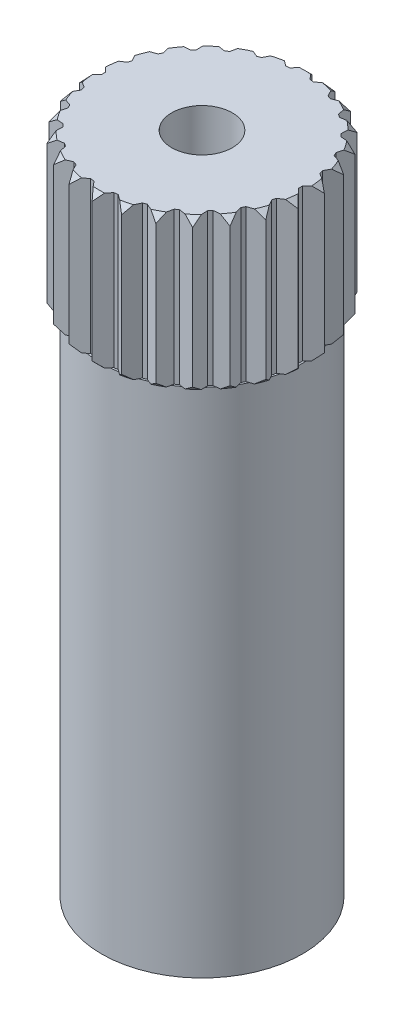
from build123d import *

# Parameters (mm, degrees)
SKETCH12_R          = 2.9
BOSS_EXTRUDE4_DEPTH = 13.5
SKETCH13_R          = 2.6
BOSS_EXTRUDE5_DEPTH = 4
BOSS_EXTRUDE6_REACH = 19.974
CIRPATTERN1_COUNT   = 26
SKETCH16_R          = 0.8
CUT_EXTRUDE1_DEPTH  = 4
SKETCH17_W          = 0.25
SKETCH17_H          = 13.5


with BuildPart() as part:
    # Sketch12 → Boss-Extrude4 (new body)
    with BuildSketch(Plane(origin=(0, 0, 0), x_dir=(1, 0, 0), z_dir=(0, 1, 0))):
        with Locations(Location((0, 0, 0), (0, 0, 270))):
            Circle(SKETCH12_R)
    extrude(amount=BOSS_EXTRUDE4_DEPTH)

    # Sketch13 → Boss-Extrude5 (add)
    with BuildSketch(Plane(origin=(0, 13.5, 0), x_dir=(1, 0, 0), z_dir=(0, 1, 0))):
        with Locations(Location((0, 0, 0), (0, 0, 270))):
            Circle(SKETCH13_R)
    extrude(amount=BOSS_EXTRUDE5_DEPTH)

    # Sketch14 → Boss-Extrude6 (add, up to next)
    with BuildSketch(Plane(origin=(0, 17.5, 0), x_dir=(1, 0, 0), z_dir=(0, 1, 0)), mode=Mode.PRIVATE) as boss_extrude6_sk1:
        with BuildLine():
            Line((0, 2.9), (-0.262912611, 2.586672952))
            ThreePointArc((-0.262912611, 2.586672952), (0, 2.6), (0.262912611, 2.586672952))
            Line((0.262912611, 2.586672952), (0, 2.9))
        make_face()
    boss_extrude6_tool1 = extrude(boss_extrude6_sk1.sketch, amount=-BOSS_EXTRUDE6_REACH, mode=Mode.PRIVATE) - part.part
    boss_extrude6 = boss_extrude6_tool1.solids().sort_by_distance((0, 17.5, -2.697077))[0]
    add(boss_extrude6)

    # CirPattern1: Boss-Extrude6 ×26 about axis
    cirpattern1_axis = Axis((0, 0, 0), (0, 1, 0))
    for i in range(1, CIRPATTERN1_COUNT):
        add(boss_extrude6.rotate(cirpattern1_axis, i * 360 / CIRPATTERN1_COUNT))

    # Sketch15 → Cut-Revolve1 (revolve, cut)
    with BuildSketch(Plane(origin=(0, 0, 0), x_dir=(0, 0, -1), z_dir=(1, 0, 0))):
        Polygon((2.9, 17.323223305), (2.9, 17.5), (2.723223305, 17.5), align=None)
    cut_revolve1 = revolve(axis=Axis((0, 17.5, 0), (0, -1, 0)), mode=Mode.SUBTRACT)

    # Sketch16 → Cut-Extrude1 (cut)
    with BuildSketch(Plane(origin=(0, 17.5, 0), x_dir=(1, 0, 0), z_dir=(0, 1, 0))):
        with Locations(Location((0, 0, 0), (0, 0, 270))):
            Circle(SKETCH16_R)
    extrude(amount=-CUT_EXTRUDE1_DEPTH, mode=Mode.SUBTRACT)

    # Sketch17 → Cut-Revolve2 (revolve, cut)
    with BuildSketch(Plane.XY, mode=Mode.PRIVATE) as cut_revolve2_sk:
        with Locations((2.775, 6.75)):
            Rectangle(SKETCH17_W, SKETCH17_H)
    revolve(cut_revolve2_sk.sketch.rotate(Axis((0, 13.5, 0), (0, -1, 0)), 90), axis=Axis((0, 13.5, 0), (0, -1, 0)), mode=Mode.SUBTRACT)

    # Mirror1: Cut-Revolve1 across plane
    add(cut_revolve1.mirror(Plane.ZX.offset(15.5)), mode=Mode.SUBTRACT)


solid = part.part
